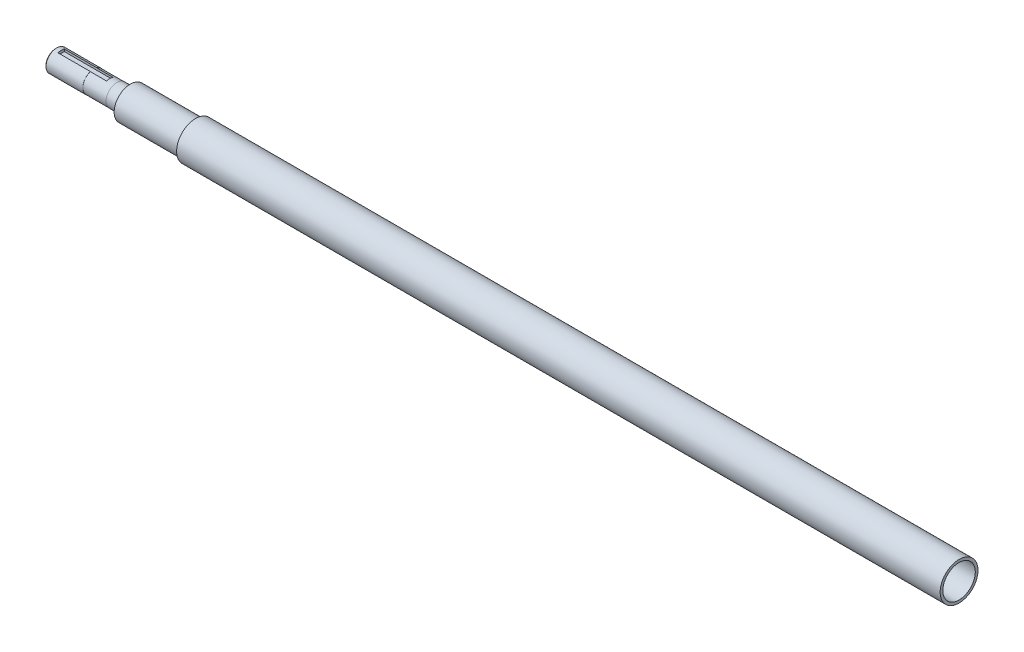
from build123d import *

# Parameters (mm, degrees)
ESQUISSE2_W                      = 12
ESQUISSE2_H                      = 6
ENL_V_MAT_EXTRU_1_DEPTH          = 90
TROU_TARAUD_M16X2_01_D           = 14
TROU_TARAUD_M16X2_01_DEPTH       = 50
TROU_TARAUD_M16X2_01_CBORE_D     = 16
TROU_TARAUD_M16X2_01_CBORE_DEPTH = 40
TROU_TARAUD_M16X2_01_TIP         = 4.206024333
CHANFREIN1_SIZE                  = 2


with BuildPart() as part:
    # Esquisse1 → Base-R_volution (revolve)
    with BuildSketch(Plane.XY, mode=Mode.PRIVATE) as base_r_volution_sk:
        Polygon((-371.5, 35), (1040.5, 35), (1040.5, 30), (630, 30), (630, 0), (-630, 0), (-630, 20), (-560, 20), (-560, 19.8), (-517, 19.8), (-517, 20), (-492, 20), (-492, 30), (-371.5, 30), align=None)
    revolve(base_r_volution_sk.sketch.rotate(Axis((1035.643400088, 0, 0), (-1, 0, 0)), 90), axis=Axis((1035.643400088, 0, 0), (-1, 0, 0)))

    # Esquisse2 → Enl_v. mat.-Extru.1 (cut)
    with BuildSketch(Plane(origin=(-620, 0, 0), x_dir=(0, 0, -1), z_dir=(1, 0, 0))):
        with Locations((0, 18)):
            Rectangle(ESQUISSE2_W, ESQUISSE2_H)
    extrude(amount=ENL_V_MAT_EXTRU_1_DEPTH, mode=Mode.SUBTRACT)

    # Trou taraud_ M16x2.01
    with Locations(Plane.ZY.offset(630)):
        with Locations((0, 0)):
            CounterBoreHole(TROU_TARAUD_M16X2_01_D / 2, TROU_TARAUD_M16X2_01_CBORE_D / 2, TROU_TARAUD_M16X2_01_CBORE_DEPTH, depth=TROU_TARAUD_M16X2_01_DEPTH)
            with Locations((0, 0, -(TROU_TARAUD_M16X2_01_DEPTH + TROU_TARAUD_M16X2_01_TIP / 2))):  # 118° drill point
                Cone(0, TROU_TARAUD_M16X2_01_D / 2, TROU_TARAUD_M16X2_01_TIP, mode=Mode.SUBTRACT)

    # Chanfrein1
    chanfrein1_edges = [part.edges().sort_by_distance(p)[0] for p in [
        (630, 0, 30),
        (-630, 0, 20),
    ]]
    chamfer(chanfrein1_edges, length=CHANFREIN1_SIZE)


solid = part.part
